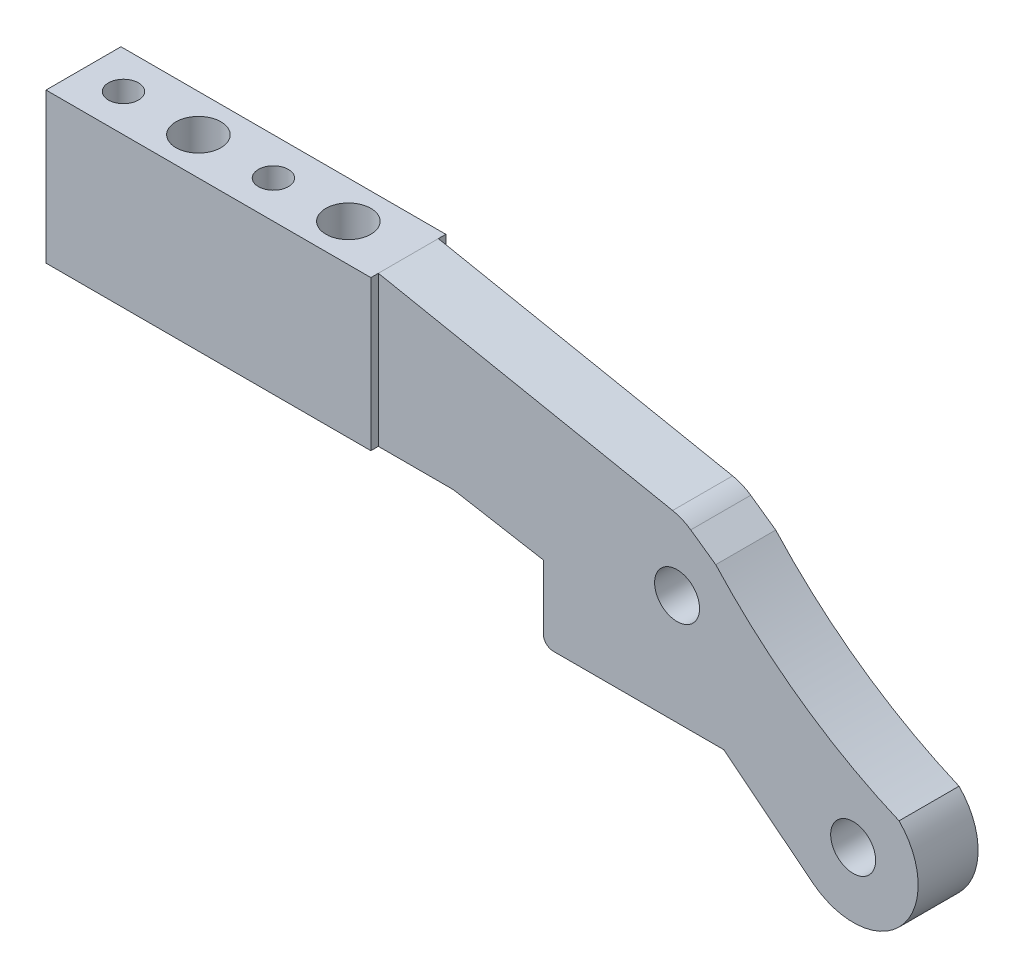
ISO-10303-21;
HEADER;
FILE_DESCRIPTION(('STEP AP214'),'2;1');
FILE_NAME('part.step','',(''),(''),'','','');
FILE_SCHEMA(('AUTOMOTIVE_DESIGN { 1 0 10303 214 1 1 1 1 }'));
ENDSEC;
DATA;
#1=APPLICATION_CONTEXT('core data for automotive mechanical design processes');
#2=APPLICATION_PROTOCOL_DEFINITION('international standard','automotive_design',2000,#1);
#3=PRODUCT_CONTEXT('',#1,'mechanical');
#4=PRODUCT('Part','Part','',(#3));
#5=PRODUCT_RELATED_PRODUCT_CATEGORY('part','',(#4));
#6=PRODUCT_DEFINITION_FORMATION('','',#4);
#7=PRODUCT_DEFINITION_CONTEXT('part definition',#1,'design');
#8=PRODUCT_DEFINITION('design','',#6,#7);
#9=PRODUCT_DEFINITION_SHAPE('','',#8);
#10=(LENGTH_UNIT() NAMED_UNIT(*) SI_UNIT(.MILLI.,.METRE.));
#11=(NAMED_UNIT(*) PLANE_ANGLE_UNIT() SI_UNIT($,.RADIAN.));
#12=(NAMED_UNIT(*) SI_UNIT($,.STERADIAN.) SOLID_ANGLE_UNIT());
#13=UNCERTAINTY_MEASURE_WITH_UNIT(LENGTH_MEASURE(1.E-05),#10,'distance_accuracy_value','');
#14=(GEOMETRIC_REPRESENTATION_CONTEXT(3) GLOBAL_UNCERTAINTY_ASSIGNED_CONTEXT((#13)) GLOBAL_UNIT_ASSIGNED_CONTEXT((#10,
#11,#12)) REPRESENTATION_CONTEXT('',''));
#15=CARTESIAN_POINT('',(0.,0.,0.));
#16=DIRECTION('',(0.,0.,1.));
#17=DIRECTION('',(1.,0.,0.));
#18=AXIS2_PLACEMENT_3D('',#15,#16,#17);
#19=CARTESIAN_POINT('',(-33.5,39.2916796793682,-19.5));
#20=DIRECTION('',(1.,0.,0.));
#21=DIRECTION('',(0.,0.,-1.));
#22=AXIS2_PLACEMENT_3D('',#19,#20,#21);
#23=PLANE('',#22);
#24=DIRECTION('',(0.,0.,-1.));
#25=VECTOR('',#24,1.);
#26=CARTESIAN_POINT('',(-33.5,106.,-19.5));
#27=LINE('',#26,#25);
#28=CARTESIAN_POINT('',(-33.5,106.,-4.5));
#29=VERTEX_POINT('',#28);
#30=CARTESIAN_POINT('',(-33.5,106.,-6.));
#31=VERTEX_POINT('',#30);
#32=EDGE_CURVE('E118',#29,#31,#27,.T.);
#33=ORIENTED_EDGE('',*,*,#32,.T.);
#34=DIRECTION('',(0.,1.,0.));
#35=VECTOR('',#34,1.);
#36=CARTESIAN_POINT('',(-33.5,84.,-6.));
#37=LINE('',#36,#35);
#38=CARTESIAN_POINT('',(-33.5,136.,-6.));
#39=VERTEX_POINT('',#38);
#40=EDGE_CURVE('E224',#39,#31,#37,.F.);
#41=ORIENTED_EDGE('',*,*,#40,.F.);
#42=DIRECTION('',(0.,0.,1.));
#43=VECTOR('',#42,1.);
#44=CARTESIAN_POINT('',(-33.5,136.,-6.));
#45=LINE('',#44,#43);
#46=CARTESIAN_POINT('',(-33.5,136.,-4.5));
#47=VERTEX_POINT('',#46);
#48=EDGE_CURVE('E155',#39,#47,#45,.T.);
#49=ORIENTED_EDGE('',*,*,#48,.T.);
#50=DIRECTION('',(0.,1.,0.));
#51=VECTOR('',#50,1.);
#52=CARTESIAN_POINT('',(-33.5,39.2916796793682,-4.5));
#53=LINE('',#52,#51);
#54=EDGE_CURVE('E158',#29,#47,#53,.T.);
#55=ORIENTED_EDGE('',*,*,#54,.F.);
#56=EDGE_LOOP('',(#33,#41,#49,#55));
#57=FACE_BOUND('',#56,.T.);
#58=ADVANCED_FACE('F14',(#57),#23,.T.);
#59=CARTESIAN_POINT('',(-33.5,136.,-6.));
#60=DIRECTION('',(0.,-1.,0.));
#61=DIRECTION('',(1.,0.,0.));
#62=AXIS2_PLACEMENT_3D('',#59,#60,#61);
#63=PLANE('',#62);
#64=CARTESIAN_POINT('',(-75.5,136.,-12.));
#65=DIRECTION('',(0.,1.,0.));
#66=DIRECTION('',(0.,0.,1.));
#67=AXIS2_PLACEMENT_3D('',#64,#65,#66);
#68=CIRCLE('',#67,4.5);
#69=CARTESIAN_POINT('',(-75.5,136.,-7.5));
#70=VERTEX_POINT('',#69);
#71=EDGE_CURVE('E221',#70,#70,#68,.F.);
#72=ORIENTED_EDGE('',*,*,#71,.T.);
#73=EDGE_LOOP('',(#72));
#74=FACE_BOUND('',#73,.T.);
#75=CARTESIAN_POINT('',(-45.5,136.,-12.));
#76=DIRECTION('',(0.,1.,0.));
#77=DIRECTION('',(0.,0.,1.));
#78=AXIS2_PLACEMENT_3D('',#75,#76,#77);
#79=CIRCLE('',#78,4.5);
#80=CARTESIAN_POINT('',(-45.5,136.,-7.5));
#81=VERTEX_POINT('',#80);
#82=EDGE_CURVE('E225',#81,#81,#79,.F.);
#83=ORIENTED_EDGE('',*,*,#82,.T.);
#84=EDGE_LOOP('',(#83));
#85=FACE_BOUND('',#84,.T.);
#86=CARTESIAN_POINT('',(-90.5,136.,-12.));
#87=DIRECTION('',(0.,1.,0.));
#88=DIRECTION('',(0.,0.,1.));
#89=AXIS2_PLACEMENT_3D('',#86,#87,#88);
#90=CIRCLE('',#89,3.);
#91=CARTESIAN_POINT('',(-90.5,136.,-9.));
#92=VERTEX_POINT('',#91);
#93=EDGE_CURVE('E227',#92,#92,#90,.F.);
#94=ORIENTED_EDGE('',*,*,#93,.T.);
#95=EDGE_LOOP('',(#94));
#96=FACE_BOUND('',#95,.T.);
#97=CARTESIAN_POINT('',(-60.5,136.,-12.));
#98=DIRECTION('',(0.,1.,0.));
#99=DIRECTION('',(0.,0.,1.));
#100=AXIS2_PLACEMENT_3D('',#97,#98,#99);
#101=CIRCLE('',#100,3.);
#102=CARTESIAN_POINT('',(-60.5,136.,-9.));
#103=VERTEX_POINT('',#102);
#104=EDGE_CURVE('E17',#103,#103,#101,.F.);
#105=ORIENTED_EDGE('',*,*,#104,.T.);
#106=EDGE_LOOP('',(#105));
#107=FACE_BOUND('',#106,.T.);
#108=DIRECTION('',(-1.,0.,0.));
#109=VECTOR('',#108,1.);
#110=CARTESIAN_POINT('',(-98.5,136.,-19.5));
#111=LINE('',#110,#109);
#112=CARTESIAN_POINT('',(-98.5,136.,-19.5));
#113=VERTEX_POINT('',#112);
#114=CARTESIAN_POINT('',(-33.5,136.,-19.5));
#115=VERTEX_POINT('',#114);
#116=EDGE_CURVE('E371',#113,#115,#111,.F.);
#117=ORIENTED_EDGE('',*,*,#116,.F.);
#118=DIRECTION('',(0.,0.,-1.));
#119=VECTOR('',#118,1.);
#120=CARTESIAN_POINT('',(-98.5,136.,-6.));
#121=LINE('',#120,#119);
#122=CARTESIAN_POINT('',(-98.5,136.,-4.5));
#123=VERTEX_POINT('',#122);
#124=EDGE_CURVE('E373',#113,#123,#121,.F.);
#125=ORIENTED_EDGE('',*,*,#124,.T.);
#126=DIRECTION('',(1.,0.,0.));
#127=VECTOR('',#126,1.);
#128=CARTESIAN_POINT('',(-98.5,136.,-4.5));
#129=LINE('',#128,#127);
#130=EDGE_CURVE('E361',#47,#123,#129,.F.);
#131=ORIENTED_EDGE('',*,*,#130,.F.);
#132=ORIENTED_EDGE('',*,*,#48,.F.);
#133=DIRECTION('',(0.,0.,1.));
#134=VECTOR('',#133,1.);
#135=CARTESIAN_POINT('',(-33.5,136.,-6.));
#136=LINE('',#135,#134);
#137=CARTESIAN_POINT('',(-33.5,136.,-18.));
#138=VERTEX_POINT('',#137);
#139=EDGE_CURVE('E334',#39,#138,#136,.F.);
#140=ORIENTED_EDGE('',*,*,#139,.T.);
#141=DIRECTION('',(0.,0.,1.));
#142=VECTOR('',#141,1.);
#143=CARTESIAN_POINT('',(-33.5,136.,-6.));
#144=LINE('',#143,#142);
#145=EDGE_CURVE('E374',#115,#138,#144,.T.);
#146=ORIENTED_EDGE('',*,*,#145,.F.);
#147=EDGE_LOOP('',(#117,#125,#131,#132,#140,#146));
#148=FACE_BOUND('',#147,.T.);
#149=ADVANCED_FACE('F234',(#74,#85,#96,#107,#148),#63,.F.);
#150=CARTESIAN_POINT('',(-98.5,39.2916796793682,-19.5));
#151=DIRECTION('',(0.,0.,-1.));
#152=DIRECTION('',(-1.,0.,0.));
#153=AXIS2_PLACEMENT_3D('',#150,#151,#152);
#154=PLANE('',#153);
#155=DIRECTION('',(1.,0.,0.));
#156=VECTOR('',#155,1.);
#157=CARTESIAN_POINT('',(-98.5,106.,-19.5));
#158=LINE('',#157,#156);
#159=CARTESIAN_POINT('',(-33.5,106.,-19.5));
#160=VERTEX_POINT('',#159);
#161=CARTESIAN_POINT('',(-98.5,106.,-19.5));
#162=VERTEX_POINT('',#161);
#163=EDGE_CURVE('E168',#160,#162,#158,.F.);
#164=ORIENTED_EDGE('',*,*,#163,.T.);
#165=DIRECTION('',(0.,1.,0.));
#166=VECTOR('',#165,1.);
#167=CARTESIAN_POINT('',(-98.5,136.,-19.5));
#168=LINE('',#167,#166);
#169=EDGE_CURVE('E396',#162,#113,#168,.T.);
#170=ORIENTED_EDGE('',*,*,#169,.T.);
#171=ORIENTED_EDGE('',*,*,#116,.T.);
#172=DIRECTION('',(0.,1.,0.));
#173=VECTOR('',#172,1.);
#174=CARTESIAN_POINT('',(-33.5,39.2916796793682,-19.5));
#175=LINE('',#174,#173);
#176=EDGE_CURVE('E126',#160,#115,#175,.T.);
#177=ORIENTED_EDGE('',*,*,#176,.F.);
#178=EDGE_LOOP('',(#164,#170,#171,#177));
#179=FACE_BOUND('',#178,.T.);
#180=ADVANCED_FACE('F407',(#179),#154,.T.);
#181=CARTESIAN_POINT('',(-98.5,136.,-6.));
#182=DIRECTION('',(1.,0.,0.));
#183=DIRECTION('',(0.,0.,-1.));
#184=AXIS2_PLACEMENT_3D('',#181,#182,#183);
#185=PLANE('',#184);
#186=DIRECTION('',(0.,0.,1.));
#187=VECTOR('',#186,1.);
#188=CARTESIAN_POINT('',(-98.5,106.,-6.));
#189=LINE('',#188,#187);
#190=CARTESIAN_POINT('',(-98.5,106.,-4.5));
#191=VERTEX_POINT('',#190);
#192=EDGE_CURVE('E163',#162,#191,#189,.T.);
#193=ORIENTED_EDGE('',*,*,#192,.T.);
#194=DIRECTION('',(0.,1.,0.));
#195=VECTOR('',#194,1.);
#196=CARTESIAN_POINT('',(-98.5,39.2916796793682,-4.5));
#197=LINE('',#196,#195);
#198=EDGE_CURVE('E145',#123,#191,#197,.F.);
#199=ORIENTED_EDGE('',*,*,#198,.F.);
#200=ORIENTED_EDGE('',*,*,#124,.F.);
#201=ORIENTED_EDGE('',*,*,#169,.F.);
#202=EDGE_LOOP('',(#193,#199,#200,#201));
#203=FACE_BOUND('',#202,.T.);
#204=ADVANCED_FACE('F406',(#203),#185,.F.);
#205=CARTESIAN_POINT('',(-98.5,39.2916796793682,-4.5));
#206=DIRECTION('',(0.,0.,1.));
#207=DIRECTION('',(1.,0.,0.));
#208=AXIS2_PLACEMENT_3D('',#205,#206,#207);
#209=PLANE('',#208);
#210=DIRECTION('',(1.,0.,0.));
#211=VECTOR('',#210,1.);
#212=CARTESIAN_POINT('',(-98.5,106.,-4.5));
#213=LINE('',#212,#211);
#214=EDGE_CURVE('E151',#191,#29,#213,.T.);
#215=ORIENTED_EDGE('',*,*,#214,.T.);
#216=ORIENTED_EDGE('',*,*,#54,.T.);
#217=ORIENTED_EDGE('',*,*,#130,.T.);
#218=ORIENTED_EDGE('',*,*,#198,.T.);
#219=EDGE_LOOP('',(#215,#216,#217,#218));
#220=FACE_BOUND('',#219,.T.);
#221=ADVANCED_FACE('F161',(#220),#209,.T.);
#222=CARTESIAN_POINT('',(-60.5,136.,-12.));
#223=DIRECTION('',(0.,1.,0.));
#224=DIRECTION('',(0.,0.,1.));
#225=AXIS2_PLACEMENT_3D('',#222,#223,#224);
#226=CYLINDRICAL_SURFACE('',#225,3.);
#227=ORIENTED_EDGE('',*,*,#104,.F.);
#228=EDGE_LOOP('',(#227));
#229=FACE_BOUND('',#228,.T.);
#230=CARTESIAN_POINT('',(-60.5,106.,-12.));
#231=DIRECTION('',(0.,1.,0.));
#232=DIRECTION('',(0.,0.,1.));
#233=AXIS2_PLACEMENT_3D('',#230,#231,#232);
#234=CIRCLE('',#233,3.);
#235=CARTESIAN_POINT('',(-60.5,106.,-9.));
#236=VERTEX_POINT('',#235);
#237=EDGE_CURVE('E162',#236,#236,#234,.F.);
#238=ORIENTED_EDGE('',*,*,#237,.T.);
#239=EDGE_LOOP('',(#238));
#240=FACE_BOUND('',#239,.T.);
#241=ADVANCED_FACE('F237',(#229,#240),#226,.F.);
#242=CARTESIAN_POINT('',(-90.5,136.,-12.));
#243=DIRECTION('',(0.,1.,0.));
#244=DIRECTION('',(0.,0.,1.));
#245=AXIS2_PLACEMENT_3D('',#242,#243,#244);
#246=CYLINDRICAL_SURFACE('',#245,3.);
#247=ORIENTED_EDGE('',*,*,#93,.F.);
#248=EDGE_LOOP('',(#247));
#249=FACE_BOUND('',#248,.T.);
#250=CARTESIAN_POINT('',(-90.5,106.,-12.));
#251=DIRECTION('',(0.,1.,0.));
#252=DIRECTION('',(0.,0.,1.));
#253=AXIS2_PLACEMENT_3D('',#250,#251,#252);
#254=CIRCLE('',#253,3.);
#255=CARTESIAN_POINT('',(-90.5,106.,-9.));
#256=VERTEX_POINT('',#255);
#257=EDGE_CURVE('E166',#256,#256,#254,.F.);
#258=ORIENTED_EDGE('',*,*,#257,.T.);
#259=EDGE_LOOP('',(#258));
#260=FACE_BOUND('',#259,.T.);
#261=ADVANCED_FACE('F240',(#249,#260),#246,.F.);
#262=CARTESIAN_POINT('',(-45.5,136.,-12.));
#263=DIRECTION('',(0.,1.,0.));
#264=DIRECTION('',(0.,0.,1.));
#265=AXIS2_PLACEMENT_3D('',#262,#263,#264);
#266=CYLINDRICAL_SURFACE('',#265,4.5);
#267=ORIENTED_EDGE('',*,*,#82,.F.);
#268=EDGE_LOOP('',(#267));
#269=FACE_BOUND('',#268,.T.);
#270=CARTESIAN_POINT('',(-45.5,106.,-12.));
#271=DIRECTION('',(0.,1.,0.));
#272=DIRECTION('',(0.,0.,1.));
#273=AXIS2_PLACEMENT_3D('',#270,#271,#272);
#274=CIRCLE('',#273,4.5);
#275=CARTESIAN_POINT('',(-45.5,106.,-7.5));
#276=VERTEX_POINT('',#275);
#277=EDGE_CURVE('E207',#276,#276,#274,.F.);
#278=ORIENTED_EDGE('',*,*,#277,.T.);
#279=EDGE_LOOP('',(#278));
#280=FACE_BOUND('',#279,.T.);
#281=ADVANCED_FACE('F479',(#269,#280),#266,.F.);
#282=CARTESIAN_POINT('',(-75.5,136.,-12.));
#283=DIRECTION('',(0.,1.,0.));
#284=DIRECTION('',(0.,0.,1.));
#285=AXIS2_PLACEMENT_3D('',#282,#283,#284);
#286=CYLINDRICAL_SURFACE('',#285,4.5);
#287=ORIENTED_EDGE('',*,*,#71,.F.);
#288=EDGE_LOOP('',(#287));
#289=FACE_BOUND('',#288,.T.);
#290=CARTESIAN_POINT('',(-75.5,106.,-12.));
#291=DIRECTION('',(0.,1.,0.));
#292=DIRECTION('',(0.,0.,1.));
#293=AXIS2_PLACEMENT_3D('',#290,#291,#292);
#294=CIRCLE('',#293,4.5);
#295=CARTESIAN_POINT('',(-75.5,106.,-7.5));
#296=VERTEX_POINT('',#295);
#297=EDGE_CURVE('E203',#296,#296,#294,.F.);
#298=ORIENTED_EDGE('',*,*,#297,.T.);
#299=EDGE_LOOP('',(#298));
#300=FACE_BOUND('',#299,.T.);
#301=ADVANCED_FACE('F475',(#289,#300),#286,.F.);
#302=CARTESIAN_POINT('',(61.5,84.,-6.));
#303=DIRECTION('',(0.,0.,1.));
#304=DIRECTION('',(1.,0.,0.));
#305=AXIS2_PLACEMENT_3D('',#302,#303,#304);
#306=PLANE('',#305);
#307=CARTESIAN_POINT('',(26.2664094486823,110.022918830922,-6.));
#308=DIRECTION('',(0.,0.,1.));
#309=DIRECTION('',(1.,0.,0.));
#310=AXIS2_PLACEMENT_3D('',#307,#308,#309);
#311=CIRCLE('',#310,4.5);
#312=CARTESIAN_POINT('',(30.7664094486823,110.022918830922,-6.));
#313=VERTEX_POINT('',#312);
#314=EDGE_CURVE('E193',#313,#313,#311,.F.);
#315=ORIENTED_EDGE('',*,*,#314,.T.);
#316=EDGE_LOOP('',(#315));
#317=FACE_BOUND('',#316,.T.);
#318=CARTESIAN_POINT('',(61.5,84.,-6.));
#319=DIRECTION('',(0.,0.,1.));
#320=DIRECTION('',(1.,0.,0.));
#321=AXIS2_PLACEMENT_3D('',#318,#319,#320);
#322=CIRCLE('',#321,4.5);
#323=CARTESIAN_POINT('',(66.,84.,-6.));
#324=VERTEX_POINT('',#323);
#325=EDGE_CURVE('E197',#324,#324,#322,.F.);
#326=ORIENTED_EDGE('',*,*,#325,.T.);
#327=EDGE_LOOP('',(#326));
#328=FACE_BOUND('',#327,.T.);
#329=DIRECTION('',(0.980923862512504,-0.194392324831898,0.));
#330=VECTOR('',#329,1.);
#331=CARTESIAN_POINT('',(25.3775141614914,124.332084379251,-6.));
#332=LINE('',#331,#330);
#333=CARTESIAN_POINT('',(25.3775141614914,124.332084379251,-6.));
#334=VERTEX_POINT('',#333);
#335=EDGE_CURVE('E333',#334,#39,#332,.F.);
#336=ORIENTED_EDGE('',*,*,#335,.T.);
#337=ORIENTED_EDGE('',*,*,#40,.T.);
#338=DIRECTION('',(1.,0.,0.));
#339=VECTOR('',#338,1.);
#340=CARTESIAN_POINT('',(-98.5,106.,-6.));
#341=LINE('',#340,#339);
#342=CARTESIAN_POINT('',(-18.5,106.,-6.));
#343=VERTEX_POINT('',#342);
#344=EDGE_CURVE('E154',#31,#343,#341,.T.);
#345=ORIENTED_EDGE('',*,*,#344,.T.);
#346=DIRECTION('',(-0.984807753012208,0.173648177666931,0.));
#347=VECTOR('',#346,1.);
#348=CARTESIAN_POINT('',(-18.5,106.,-6.));
#349=LINE('',#348,#347);
#350=CARTESIAN_POINT('',(-0.500000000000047,102.826114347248,-6.));
#351=VERTEX_POINT('',#350);
#352=EDGE_CURVE('E299',#343,#351,#349,.F.);
#353=ORIENTED_EDGE('',*,*,#352,.T.);
#354=DIRECTION('',(0.,1.,0.));
#355=VECTOR('',#354,1.);
#356=CARTESIAN_POINT('',(-0.500000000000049,102.826114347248,-6.));
#357=LINE('',#356,#355);
#358=CARTESIAN_POINT('',(-0.500000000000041,90.,-6.));
#359=VERTEX_POINT('',#358);
#360=EDGE_CURVE('E291',#351,#359,#357,.F.);
#361=ORIENTED_EDGE('',*,*,#360,.T.);
#362=CARTESIAN_POINT('',(1.49999999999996,90.,-6.));
#363=DIRECTION('',(0.,0.,-1.));
#364=DIRECTION('',(-1.,0.,0.));
#365=AXIS2_PLACEMENT_3D('',#362,#363,#364);
#366=CIRCLE('',#365,2.);
#367=CARTESIAN_POINT('',(1.49999999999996,88.,-6.));
#368=VERTEX_POINT('',#367);
#369=EDGE_CURVE('E200',#368,#359,#366,.T.);
#370=ORIENTED_EDGE('',*,*,#369,.F.);
#371=DIRECTION('',(-1.,0.,0.));
#372=VECTOR('',#371,1.);
#373=CARTESIAN_POINT('',(-0.500000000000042,88.,-6.));
#374=LINE('',#373,#372);
#375=CARTESIAN_POINT('',(35.5901469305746,88.,-6.));
#376=VERTEX_POINT('',#375);
#377=EDGE_CURVE('E92',#368,#376,#374,.F.);
#378=ORIENTED_EDGE('',*,*,#377,.T.);
#379=DIRECTION('',(-0.782576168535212,0.622554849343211,0.));
#380=VECTOR('',#379,1.);
#381=CARTESIAN_POINT('',(35.5901469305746,88.,-6.));
#382=LINE('',#381,#380);
#383=CARTESIAN_POINT('',(53.4067869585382,73.8265098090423,-6.));
#384=VERTEX_POINT('',#383);
#385=EDGE_CURVE('E87',#376,#384,#382,.F.);
#386=ORIENTED_EDGE('',*,*,#385,.T.);
#387=CARTESIAN_POINT('',(61.5,84.,-6.));
#388=DIRECTION('',(0.,0.,-1.));
#389=DIRECTION('',(-1.,0.,0.));
#390=AXIS2_PLACEMENT_3D('',#387,#388,#389);
#391=CIRCLE('',#390,13.);
#392=CARTESIAN_POINT('',(70.678952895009,93.2058038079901,-6.));
#393=VERTEX_POINT('',#392);
#394=EDGE_CURVE('E218',#393,#384,#391,.T.);
#395=ORIENTED_EDGE('',*,*,#394,.F.);
#396=CARTESIAN_POINT('',(112.574167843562,191.029004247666,-6.));
#397=DIRECTION('',(0.,0.,-1.));
#398=DIRECTION('',(-1.,0.,0.));
#399=AXIS2_PLACEMENT_3D('',#396,#397,#398);
#400=CIRCLE('',#399,106.417045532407);
#401=CARTESIAN_POINT('',(34.,119.260712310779,-6.));
#402=VERTEX_POINT('',#401);
#403=EDGE_CURVE('E80',#393,#402,#400,.T.);
#404=ORIENTED_EDGE('',*,*,#403,.T.);
#405=DIRECTION('',(0.817666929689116,-0.575691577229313,0.));
#406=VECTOR('',#405,1.);
#407=CARTESIAN_POINT('',(68.983990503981,94.6296700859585,-6.));
#408=LINE('',#407,#406);
#409=CARTESIAN_POINT('',(28.9998570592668,122.781143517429,-6.));
#410=VERTEX_POINT('',#409);
#411=EDGE_CURVE('E215',#402,#410,#408,.F.);
#412=ORIENTED_EDGE('',*,*,#411,.T.);
#413=CARTESIAN_POINT('',(23.5307870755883,115.013307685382,-6.));
#414=DIRECTION('',(0.,0.,-1.));
#415=DIRECTION('',(-1.,0.,0.));
#416=AXIS2_PLACEMENT_3D('',#413,#414,#415);
#417=CIRCLE('',#416,9.5);
#418=EDGE_CURVE('E212',#334,#410,#417,.T.);
#419=ORIENTED_EDGE('',*,*,#418,.F.);
#420=EDGE_LOOP('',(#336,#337,#345,#353,#361,#370,#378,#386,#395,#404,#412,#419));
#421=FACE_BOUND('',#420,.T.);
#422=ADVANCED_FACE('F442',(#317,#328,#421),#306,.T.);
#423=CARTESIAN_POINT('',(-0.500000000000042,88.,-6.));
#424=DIRECTION('',(0.,1.,0.));
#425=DIRECTION('',(-1.,0.,0.));
#426=AXIS2_PLACEMENT_3D('',#423,#424,#425);
#427=PLANE('',#426);
#428=DIRECTION('',(1.,0.,0.));
#429=VECTOR('',#428,1.);
#430=CARTESIAN_POINT('',(61.5,88.,-18.));
#431=LINE('',#430,#429);
#432=CARTESIAN_POINT('',(1.49999999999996,88.,-18.));
#433=VERTEX_POINT('',#432);
#434=CARTESIAN_POINT('',(35.5901469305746,88.,-18.));
#435=VERTEX_POINT('',#434);
#436=EDGE_CURVE('E196',#433,#435,#431,.T.);
#437=ORIENTED_EDGE('',*,*,#436,.T.);
#438=DIRECTION('',(0.,0.,1.));
#439=VECTOR('',#438,1.);
#440=CARTESIAN_POINT('',(35.5901469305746,88.,-6.));
#441=LINE('',#440,#439);
#442=EDGE_CURVE('E345',#435,#376,#441,.T.);
#443=ORIENTED_EDGE('',*,*,#442,.T.);
#444=ORIENTED_EDGE('',*,*,#377,.F.);
#445=DIRECTION('',(0.,0.,-1.));
#446=VECTOR('',#445,1.);
#447=CARTESIAN_POINT('',(1.49999999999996,88.,-6.));
#448=LINE('',#447,#446);
#449=EDGE_CURVE('E202',#433,#368,#448,.F.);
#450=ORIENTED_EDGE('',*,*,#449,.F.);
#451=EDGE_LOOP('',(#437,#443,#444,#450));
#452=FACE_BOUND('',#451,.T.);
#453=ADVANCED_FACE('F431',(#452),#427,.F.);
#454=CARTESIAN_POINT('',(35.5901469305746,88.,-6.));
#455=DIRECTION('',(0.622554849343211,0.782576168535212,0.));
#456=DIRECTION('',(-0.782576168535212,0.622554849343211,0.));
#457=AXIS2_PLACEMENT_3D('',#454,#455,#456);
#458=PLANE('',#457);
#459=ORIENTED_EDGE('',*,*,#385,.F.);
#460=ORIENTED_EDGE('',*,*,#442,.F.);
#461=DIRECTION('',(0.782576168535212,-0.62255484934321,0.));
#462=VECTOR('',#461,1.);
#463=CARTESIAN_POINT('',(35.5901469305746,88.,-18.));
#464=LINE('',#463,#462);
#465=CARTESIAN_POINT('',(53.4067869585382,73.8265098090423,-18.));
#466=VERTEX_POINT('',#465);
#467=EDGE_CURVE('E192',#435,#466,#464,.T.);
#468=ORIENTED_EDGE('',*,*,#467,.T.);
#469=DIRECTION('',(0.,0.,-1.));
#470=VECTOR('',#469,1.);
#471=CARTESIAN_POINT('',(53.4067869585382,73.8265098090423,-6.));
#472=LINE('',#471,#470);
#473=EDGE_CURVE('E220',#384,#466,#472,.T.);
#474=ORIENTED_EDGE('',*,*,#473,.F.);
#475=EDGE_LOOP('',(#459,#460,#468,#474));
#476=FACE_BOUND('',#475,.T.);
#477=ADVANCED_FACE('F439',(#476),#458,.F.);
#478=CARTESIAN_POINT('',(61.5,84.,-6.));
#479=DIRECTION('',(0.,0.,-1.));
#480=DIRECTION('',(-1.,0.,0.));
#481=AXIS2_PLACEMENT_3D('',#478,#479,#480);
#482=CYLINDRICAL_SURFACE('',#481,13.);
#483=DIRECTION('',(0.,0.,-1.));
#484=VECTOR('',#483,1.);
#485=CARTESIAN_POINT('',(70.678952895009,93.2058038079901,240.76968632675));
#486=LINE('',#485,#484);
#487=CARTESIAN_POINT('',(70.678952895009,93.2058038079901,-18.));
#488=VERTEX_POINT('',#487);
#489=EDGE_CURVE('E217',#488,#393,#486,.F.);
#490=ORIENTED_EDGE('',*,*,#489,.T.);
#491=ORIENTED_EDGE('',*,*,#394,.T.);
#492=ORIENTED_EDGE('',*,*,#473,.T.);
#493=CARTESIAN_POINT('',(61.5,84.,-18.));
#494=DIRECTION('',(0.,0.,-1.));
#495=DIRECTION('',(-1.,0.,0.));
#496=AXIS2_PLACEMENT_3D('',#493,#494,#495);
#497=CIRCLE('',#496,13.);
#498=EDGE_CURVE('E189',#466,#488,#497,.F.);
#499=ORIENTED_EDGE('',*,*,#498,.T.);
#500=EDGE_LOOP('',(#490,#491,#492,#499));
#501=FACE_BOUND('',#500,.T.);
#502=ADVANCED_FACE('F441',(#501),#482,.T.);
#503=CARTESIAN_POINT('',(112.574167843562,191.029004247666,240.76968632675));
#504=DIRECTION('',(0.,0.,-1.));
#505=DIRECTION('',(-1.,0.,0.));
#506=AXIS2_PLACEMENT_3D('',#503,#504,#505);
#507=CYLINDRICAL_SURFACE('',#506,106.417045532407);
#508=CARTESIAN_POINT('',(112.574167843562,191.029004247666,-18.));
#509=DIRECTION('',(0.,0.,-1.));
#510=DIRECTION('',(-1.,0.,0.));
#511=AXIS2_PLACEMENT_3D('',#508,#509,#510);
#512=CIRCLE('',#511,106.417045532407);
#513=CARTESIAN_POINT('',(33.9999999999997,119.26071231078,-18.));
#514=VERTEX_POINT('',#513);
#515=EDGE_CURVE('E186',#488,#514,#512,.T.);
#516=ORIENTED_EDGE('',*,*,#515,.T.);
#517=DIRECTION('',(0.,0.,1.));
#518=VECTOR('',#517,1.);
#519=CARTESIAN_POINT('',(34.,119.260712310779,-6.));
#520=LINE('',#519,#518);
#521=EDGE_CURVE('E340',#514,#402,#520,.T.);
#522=ORIENTED_EDGE('',*,*,#521,.T.);
#523=ORIENTED_EDGE('',*,*,#403,.F.);
#524=ORIENTED_EDGE('',*,*,#489,.F.);
#525=EDGE_LOOP('',(#516,#522,#523,#524));
#526=FACE_BOUND('',#525,.T.);
#527=ADVANCED_FACE('F448',(#526),#507,.F.);
#528=CARTESIAN_POINT('',(68.983990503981,94.6296700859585,-6.));
#529=DIRECTION('',(-0.575691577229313,-0.817666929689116,0.));
#530=DIRECTION('',(0.817666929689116,-0.575691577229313,0.));
#531=AXIS2_PLACEMENT_3D('',#528,#529,#530);
#532=PLANE('',#531);
#533=DIRECTION('',(0.,0.,-1.));
#534=VECTOR('',#533,1.);
#535=CARTESIAN_POINT('',(28.9998570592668,122.781143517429,-6.));
#536=LINE('',#535,#534);
#537=CARTESIAN_POINT('',(28.9998570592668,122.781143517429,-18.));
#538=VERTEX_POINT('',#537);
#539=EDGE_CURVE('E214',#410,#538,#536,.T.);
#540=ORIENTED_EDGE('',*,*,#539,.F.);
#541=ORIENTED_EDGE('',*,*,#411,.F.);
#542=ORIENTED_EDGE('',*,*,#521,.F.);
#543=DIRECTION('',(-0.817666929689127,0.575691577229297,0.));
#544=VECTOR('',#543,1.);
#545=CARTESIAN_POINT('',(34.,119.260712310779,-18.));
#546=LINE('',#545,#544);
#547=EDGE_CURVE('E185',#514,#538,#546,.T.);
#548=ORIENTED_EDGE('',*,*,#547,.T.);
#549=EDGE_LOOP('',(#540,#541,#542,#548));
#550=FACE_BOUND('',#549,.T.);
#551=ADVANCED_FACE('F446',(#550),#532,.F.);
#552=CARTESIAN_POINT('',(23.5307870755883,115.013307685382,-6.));
#553=DIRECTION('',(0.,0.,-1.));
#554=DIRECTION('',(-1.,0.,0.));
#555=AXIS2_PLACEMENT_3D('',#552,#553,#554);
#556=CYLINDRICAL_SURFACE('',#555,9.5);
#557=CARTESIAN_POINT('',(23.5307870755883,115.013307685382,-18.));
#558=DIRECTION('',(0.,0.,-1.));
#559=DIRECTION('',(-1.,0.,0.));
#560=AXIS2_PLACEMENT_3D('',#557,#558,#559);
#561=CIRCLE('',#560,9.5);
#562=CARTESIAN_POINT('',(25.3775141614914,124.332084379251,-18.));
#563=VERTEX_POINT('',#562);
#564=EDGE_CURVE('E181',#538,#563,#561,.F.);
#565=ORIENTED_EDGE('',*,*,#564,.T.);
#566=DIRECTION('',(0.,0.,1.));
#567=VECTOR('',#566,1.);
#568=CARTESIAN_POINT('',(25.3775141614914,124.332084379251,-6.));
#569=LINE('',#568,#567);
#570=EDGE_CURVE('E330',#563,#334,#569,.T.);
#571=ORIENTED_EDGE('',*,*,#570,.T.);
#572=ORIENTED_EDGE('',*,*,#418,.T.);
#573=ORIENTED_EDGE('',*,*,#539,.T.);
#574=EDGE_LOOP('',(#565,#571,#572,#573));
#575=FACE_BOUND('',#574,.T.);
#576=ADVANCED_FACE('F451',(#575),#556,.T.);
#577=CARTESIAN_POINT('',(25.3775141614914,124.332084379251,-6.));
#578=DIRECTION('',(-0.194392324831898,-0.980923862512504,0.));
#579=DIRECTION('',(0.980923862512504,-0.194392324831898,0.));
#580=AXIS2_PLACEMENT_3D('',#577,#578,#579);
#581=PLANE('',#580);
#582=ORIENTED_EDGE('',*,*,#335,.F.);
#583=ORIENTED_EDGE('',*,*,#570,.F.);
#584=DIRECTION('',(-0.980923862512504,0.194392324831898,0.));
#585=VECTOR('',#584,1.);
#586=CARTESIAN_POINT('',(25.3775141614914,124.332084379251,-18.));
#587=LINE('',#586,#585);
#588=EDGE_CURVE('E184',#563,#138,#587,.T.);
#589=ORIENTED_EDGE('',*,*,#588,.T.);
#590=ORIENTED_EDGE('',*,*,#139,.F.);
#591=EDGE_LOOP('',(#582,#583,#589,#590));
#592=FACE_BOUND('',#591,.T.);
#593=ADVANCED_FACE('F258',(#592),#581,.F.);
#594=CARTESIAN_POINT('',(-33.5,39.2916796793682,-19.5));
#595=DIRECTION('',(1.,0.,0.));
#596=DIRECTION('',(0.,0.,-1.));
#597=AXIS2_PLACEMENT_3D('',#594,#595,#596);
#598=PLANE('',#597);
#599=DIRECTION('',(0.,1.,0.));
#600=VECTOR('',#599,1.);
#601=CARTESIAN_POINT('',(-33.5,84.,-18.));
#602=LINE('',#601,#600);
#603=CARTESIAN_POINT('',(-33.5,106.,-18.));
#604=VERTEX_POINT('',#603);
#605=EDGE_CURVE('E318',#138,#604,#602,.F.);
#606=ORIENTED_EDGE('',*,*,#605,.T.);
#607=DIRECTION('',(0.,0.,1.));
#608=VECTOR('',#607,1.);
#609=CARTESIAN_POINT('',(-33.5,106.,-6.));
#610=LINE('',#609,#608);
#611=EDGE_CURVE('E321',#604,#160,#610,.F.);
#612=ORIENTED_EDGE('',*,*,#611,.T.);
#613=ORIENTED_EDGE('',*,*,#176,.T.);
#614=ORIENTED_EDGE('',*,*,#145,.T.);
#615=EDGE_LOOP('',(#606,#612,#613,#614));
#616=FACE_BOUND('',#615,.T.);
#617=ADVANCED_FACE('F246',(#616),#598,.T.);
#618=CARTESIAN_POINT('',(-98.5,106.,-6.));
#619=DIRECTION('',(0.,1.,0.));
#620=DIRECTION('',(0.,0.,1.));
#621=AXIS2_PLACEMENT_3D('',#618,#619,#620);
#622=PLANE('',#621);
#623=ORIENTED_EDGE('',*,*,#297,.F.);
#624=EDGE_LOOP('',(#623));
#625=FACE_BOUND('',#624,.T.);
#626=ORIENTED_EDGE('',*,*,#277,.F.);
#627=EDGE_LOOP('',(#626));
#628=FACE_BOUND('',#627,.T.);
#629=ORIENTED_EDGE('',*,*,#257,.F.);
#630=EDGE_LOOP('',(#629));
#631=FACE_BOUND('',#630,.T.);
#632=ORIENTED_EDGE('',*,*,#237,.F.);
#633=EDGE_LOOP('',(#632));
#634=FACE_BOUND('',#633,.T.);
#635=ORIENTED_EDGE('',*,*,#214,.F.);
#636=ORIENTED_EDGE('',*,*,#192,.F.);
#637=ORIENTED_EDGE('',*,*,#163,.F.);
#638=ORIENTED_EDGE('',*,*,#611,.F.);
#639=DIRECTION('',(1.,0.,0.));
#640=VECTOR('',#639,1.);
#641=CARTESIAN_POINT('',(61.5,106.,-18.));
#642=LINE('',#641,#640);
#643=CARTESIAN_POINT('',(-18.5000000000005,106.,-18.));
#644=VERTEX_POINT('',#643);
#645=EDGE_CURVE('E310',#604,#644,#642,.T.);
#646=ORIENTED_EDGE('',*,*,#645,.T.);
#647=DIRECTION('',(0.,0.,1.));
#648=VECTOR('',#647,1.);
#649=CARTESIAN_POINT('',(-18.5,106.,-6.));
#650=LINE('',#649,#648);
#651=EDGE_CURVE('E206',#644,#343,#650,.T.);
#652=ORIENTED_EDGE('',*,*,#651,.T.);
#653=ORIENTED_EDGE('',*,*,#344,.F.);
#654=ORIENTED_EDGE('',*,*,#32,.F.);
#655=EDGE_LOOP('',(#635,#636,#637,#638,#646,#652,#653,#654));
#656=FACE_BOUND('',#655,.T.);
#657=ADVANCED_FACE('F149',(#625,#628,#631,#634,#656),#622,.F.);
#658=CARTESIAN_POINT('',(-18.5,106.,-6.));
#659=DIRECTION('',(0.173648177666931,0.984807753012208,0.));
#660=DIRECTION('',(-0.984807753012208,0.173648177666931,0.));
#661=AXIS2_PLACEMENT_3D('',#658,#659,#660);
#662=PLANE('',#661);
#663=ORIENTED_EDGE('',*,*,#352,.F.);
#664=ORIENTED_EDGE('',*,*,#651,.F.);
#665=DIRECTION('',(0.984807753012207,-0.173648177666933,0.));
#666=VECTOR('',#665,1.);
#667=CARTESIAN_POINT('',(-18.5,106.,-18.));
#668=LINE('',#667,#666);
#669=CARTESIAN_POINT('',(-0.500000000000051,102.826114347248,-18.));
#670=VERTEX_POINT('',#669);
#671=EDGE_CURVE('E301',#644,#670,#668,.T.);
#672=ORIENTED_EDGE('',*,*,#671,.T.);
#673=DIRECTION('',(0.,0.,1.));
#674=VECTOR('',#673,1.);
#675=CARTESIAN_POINT('',(-0.500000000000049,102.826114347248,-6.));
#676=LINE('',#675,#674);
#677=EDGE_CURVE('E294',#670,#351,#676,.T.);
#678=ORIENTED_EDGE('',*,*,#677,.T.);
#679=EDGE_LOOP('',(#663,#664,#672,#678));
#680=FACE_BOUND('',#679,.T.);
#681=ADVANCED_FACE('F245',(#680),#662,.F.);
#682=CARTESIAN_POINT('',(-0.500000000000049,102.826114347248,-6.));
#683=DIRECTION('',(1.,0.,0.));
#684=DIRECTION('',(0.,1.,0.));
#685=AXIS2_PLACEMENT_3D('',#682,#683,#684);
#686=PLANE('',#685);
#687=ORIENTED_EDGE('',*,*,#360,.F.);
#688=ORIENTED_EDGE('',*,*,#677,.F.);
#689=DIRECTION('',(0.,1.,0.));
#690=VECTOR('',#689,1.);
#691=CARTESIAN_POINT('',(-0.500000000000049,84.,-18.));
#692=LINE('',#691,#690);
#693=CARTESIAN_POINT('',(-0.500000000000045,90.,-18.));
#694=VERTEX_POINT('',#693);
#695=EDGE_CURVE('E180',#670,#694,#692,.F.);
#696=ORIENTED_EDGE('',*,*,#695,.T.);
#697=DIRECTION('',(0.,0.,-1.));
#698=VECTOR('',#697,1.);
#699=CARTESIAN_POINT('',(-0.50000000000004,90.,-6.));
#700=LINE('',#699,#698);
#701=EDGE_CURVE('E32',#359,#694,#700,.T.);
#702=ORIENTED_EDGE('',*,*,#701,.F.);
#703=EDGE_LOOP('',(#687,#688,#696,#702));
#704=FACE_BOUND('',#703,.T.);
#705=ADVANCED_FACE('F255',(#704),#686,.F.);
#706=CARTESIAN_POINT('',(1.49999999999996,90.,-6.));
#707=DIRECTION('',(0.,0.,-1.));
#708=DIRECTION('',(-1.,0.,0.));
#709=AXIS2_PLACEMENT_3D('',#706,#707,#708);
#710=CYLINDRICAL_SURFACE('',#709,2.);
#711=ORIENTED_EDGE('',*,*,#369,.T.);
#712=ORIENTED_EDGE('',*,*,#701,.T.);
#713=CARTESIAN_POINT('',(1.49999999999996,90.,-18.));
#714=DIRECTION('',(0.,0.,-1.));
#715=DIRECTION('',(-1.,0.,0.));
#716=AXIS2_PLACEMENT_3D('',#713,#714,#715);
#717=CIRCLE('',#716,2.);
#718=EDGE_CURVE('E178',#694,#433,#717,.F.);
#719=ORIENTED_EDGE('',*,*,#718,.T.);
#720=ORIENTED_EDGE('',*,*,#449,.T.);
#721=EDGE_LOOP('',(#711,#712,#719,#720));
#722=FACE_BOUND('',#721,.T.);
#723=ADVANCED_FACE('F280',(#722),#710,.T.);
#724=CARTESIAN_POINT('',(61.5,84.,-6.));
#725=DIRECTION('',(0.,0.,1.));
#726=DIRECTION('',(1.,0.,0.));
#727=AXIS2_PLACEMENT_3D('',#724,#725,#726);
#728=CYLINDRICAL_SURFACE('',#727,4.5);
#729=CARTESIAN_POINT('',(61.5,84.,-18.));
#730=DIRECTION('',(0.,0.,1.));
#731=DIRECTION('',(1.,0.,0.));
#732=AXIS2_PLACEMENT_3D('',#729,#730,#731);
#733=CIRCLE('',#732,4.5);
#734=CARTESIAN_POINT('',(66.,84.,-18.));
#735=VERTEX_POINT('',#734);
#736=EDGE_CURVE('E23',#735,#735,#733,.F.);
#737=ORIENTED_EDGE('',*,*,#736,.T.);
#738=EDGE_LOOP('',(#737));
#739=FACE_BOUND('',#738,.T.);
#740=ORIENTED_EDGE('',*,*,#325,.F.);
#741=EDGE_LOOP('',(#740));
#742=FACE_BOUND('',#741,.T.);
#743=ADVANCED_FACE('F272',(#739,#742),#728,.F.);
#744=CARTESIAN_POINT('',(26.2664094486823,110.022918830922,-6.));
#745=DIRECTION('',(0.,0.,1.));
#746=DIRECTION('',(1.,0.,0.));
#747=AXIS2_PLACEMENT_3D('',#744,#745,#746);
#748=CYLINDRICAL_SURFACE('',#747,4.5);
#749=CARTESIAN_POINT('',(26.2664094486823,110.022918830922,-18.));
#750=DIRECTION('',(0.,0.,1.));
#751=DIRECTION('',(1.,0.,0.));
#752=AXIS2_PLACEMENT_3D('',#749,#750,#751);
#753=CIRCLE('',#752,4.5);
#754=CARTESIAN_POINT('',(30.7664094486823,110.022918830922,-18.));
#755=VERTEX_POINT('',#754);
#756=EDGE_CURVE('E9',#755,#755,#753,.F.);
#757=ORIENTED_EDGE('',*,*,#756,.T.);
#758=EDGE_LOOP('',(#757));
#759=FACE_BOUND('',#758,.T.);
#760=ORIENTED_EDGE('',*,*,#314,.F.);
#761=EDGE_LOOP('',(#760));
#762=FACE_BOUND('',#761,.T.);
#763=ADVANCED_FACE('F265',(#759,#762),#748,.F.);
#764=CARTESIAN_POINT('',(61.5,84.,-18.));
#765=DIRECTION('',(0.,0.,1.));
#766=DIRECTION('',(1.,0.,0.));
#767=AXIS2_PLACEMENT_3D('',#764,#765,#766);
#768=PLANE('',#767);
#769=ORIENTED_EDGE('',*,*,#756,.F.);
#770=EDGE_LOOP('',(#769));
#771=FACE_BOUND('',#770,.T.);
#772=ORIENTED_EDGE('',*,*,#736,.F.);
#773=EDGE_LOOP('',(#772));
#774=FACE_BOUND('',#773,.T.);
#775=ORIENTED_EDGE('',*,*,#695,.F.);
#776=ORIENTED_EDGE('',*,*,#671,.F.);
#777=ORIENTED_EDGE('',*,*,#645,.F.);
#778=ORIENTED_EDGE('',*,*,#605,.F.);
#779=ORIENTED_EDGE('',*,*,#588,.F.);
#780=ORIENTED_EDGE('',*,*,#564,.F.);
#781=ORIENTED_EDGE('',*,*,#547,.F.);
#782=ORIENTED_EDGE('',*,*,#515,.F.);
#783=ORIENTED_EDGE('',*,*,#498,.F.);
#784=ORIENTED_EDGE('',*,*,#467,.F.);
#785=ORIENTED_EDGE('',*,*,#436,.F.);
#786=ORIENTED_EDGE('',*,*,#718,.F.);
#787=EDGE_LOOP('',(#775,#776,#777,#778,#779,#780,#781,#782,#783,#784,#785,#786));
#788=FACE_BOUND('',#787,.T.);
#789=ADVANCED_FACE('F263',(#771,#774,#788),#768,.F.);
#790=CLOSED_SHELL('',(#58,#149,#180,#204,#221,#241,#261,#281,#301,#422,#453,#477,#502,#527,#551,
#576,#593,#617,#657,#681,#705,#723,#743,#763,#789));
#791=MANIFOLD_SOLID_BREP('B1',#790);
#792=ADVANCED_BREP_SHAPE_REPRESENTATION('',(#18,#791),#14);
#793=SHAPE_DEFINITION_REPRESENTATION(#9,#792);
ENDSEC;
END-ISO-10303-21;
